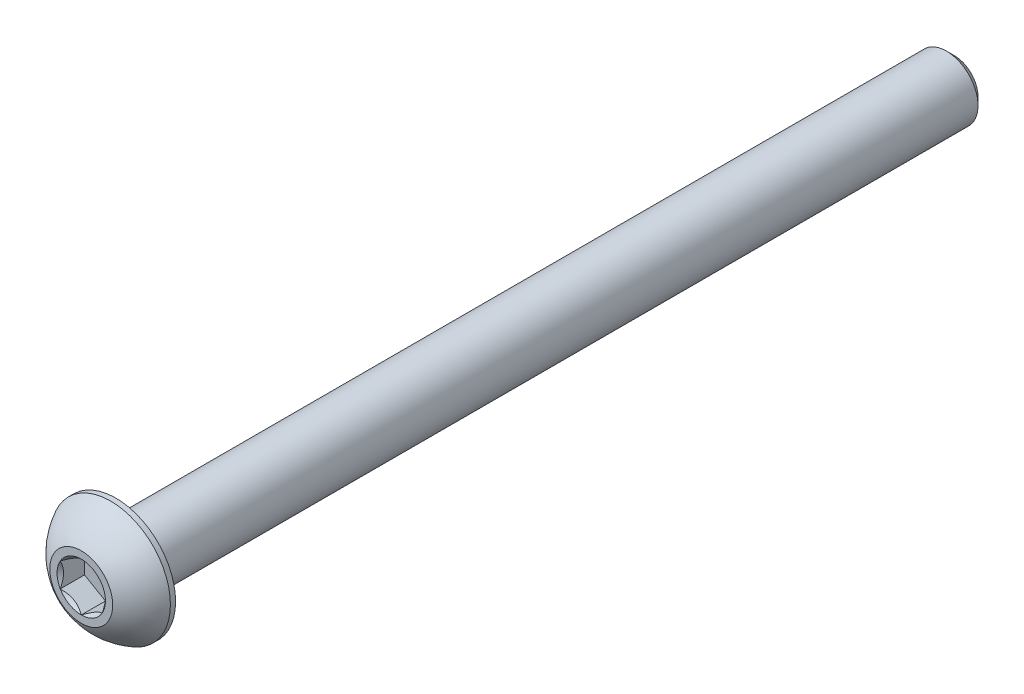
ISO-10303-21;
HEADER;
FILE_DESCRIPTION(('STEP AP214'),'2;1');
FILE_NAME('part.step','',(''),(''),'','','');
FILE_SCHEMA(('AUTOMOTIVE_DESIGN { 1 0 10303 214 1 1 1 1 }'));
ENDSEC;
DATA;
#1=APPLICATION_CONTEXT('core data for automotive mechanical design processes');
#2=APPLICATION_PROTOCOL_DEFINITION('international standard','automotive_design',2000,#1);
#3=PRODUCT_CONTEXT('',#1,'mechanical');
#4=PRODUCT('Part','Part','',(#3));
#5=PRODUCT_RELATED_PRODUCT_CATEGORY('part','',(#4));
#6=PRODUCT_DEFINITION_FORMATION('','',#4);
#7=PRODUCT_DEFINITION_CONTEXT('part definition',#1,'design');
#8=PRODUCT_DEFINITION('design','',#6,#7);
#9=PRODUCT_DEFINITION_SHAPE('','',#8);
#10=(LENGTH_UNIT() NAMED_UNIT(*) SI_UNIT(.MILLI.,.METRE.));
#11=(NAMED_UNIT(*) PLANE_ANGLE_UNIT() SI_UNIT($,.RADIAN.));
#12=(NAMED_UNIT(*) SI_UNIT($,.STERADIAN.) SOLID_ANGLE_UNIT());
#13=UNCERTAINTY_MEASURE_WITH_UNIT(LENGTH_MEASURE(1.E-05),#10,'distance_accuracy_value','');
#14=(GEOMETRIC_REPRESENTATION_CONTEXT(3) GLOBAL_UNCERTAINTY_ASSIGNED_CONTEXT((#13)) GLOBAL_UNIT_ASSIGNED_CONTEXT((#10,
#11,#12)) REPRESENTATION_CONTEXT('',''));
#15=CARTESIAN_POINT('',(0.,0.,0.));
#16=DIRECTION('',(0.,0.,1.));
#17=DIRECTION('',(1.,0.,0.));
#18=AXIS2_PLACEMENT_3D('',#15,#16,#17);
#19=CARTESIAN_POINT('',(0.,-1.5,-41.65));
#20=DIRECTION('',(0.,0.,-1.));
#21=DIRECTION('',(0.,1.,0.));
#22=AXIS2_PLACEMENT_3D('',#19,#20,#21);
#23=PLANE('',#22);
#24=CARTESIAN_POINT('',(0.,0.,-41.65));
#25=DIRECTION('',(0.,0.,-1.));
#26=DIRECTION('',(0.,1.,0.));
#27=AXIS2_PLACEMENT_3D('',#24,#25,#26);
#28=CIRCLE('',#27,1.12499999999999);
#29=CARTESIAN_POINT('',(0.,1.125,-41.65));
#30=VERTEX_POINT('',#29);
#31=EDGE_CURVE('E174',#30,#30,#28,.T.);
#32=ORIENTED_EDGE('',*,*,#31,.T.);
#33=EDGE_LOOP('',(#32));
#34=FACE_BOUND('',#33,.T.);
#35=ADVANCED_FACE('F34',(#34),#23,.T.);
#36=CARTESIAN_POINT('',(0.,0.,-41.65));
#37=DIRECTION('',(0.,0.,-1.));
#38=DIRECTION('',(0.,1.,0.));
#39=AXIS2_PLACEMENT_3D('',#36,#37,#38);
#40=CYLINDRICAL_SURFACE('',#39,1.5);
#41=CARTESIAN_POINT('',(0.,0.,-41.275));
#42=DIRECTION('',(0.,0.,-1.));
#43=DIRECTION('',(0.,1.,0.));
#44=AXIS2_PLACEMENT_3D('',#41,#42,#43);
#45=CIRCLE('',#44,1.5);
#46=CARTESIAN_POINT('',(0.,1.5,-41.275));
#47=VERTEX_POINT('',#46);
#48=EDGE_CURVE('E48',#47,#47,#45,.F.);
#49=ORIENTED_EDGE('',*,*,#48,.T.);
#50=EDGE_LOOP('',(#49));
#51=FACE_BOUND('',#50,.T.);
#52=CARTESIAN_POINT('',(0.,0.,-1.65));
#53=DIRECTION('',(0.,0.,1.));
#54=DIRECTION('',(1.,0.,0.));
#55=AXIS2_PLACEMENT_3D('',#52,#53,#54);
#56=CIRCLE('',#55,1.5);
#57=CARTESIAN_POINT('',(1.5,0.,-1.65));
#58=VERTEX_POINT('',#57);
#59=EDGE_CURVE('E171',#58,#58,#56,.F.);
#60=ORIENTED_EDGE('',*,*,#59,.T.);
#61=EDGE_LOOP('',(#60));
#62=FACE_BOUND('',#61,.T.);
#63=ADVANCED_FACE('F179',(#51,#62),#40,.T.);
#64=CARTESIAN_POINT('',(0.,0.,-41.65));
#65=DIRECTION('',(0.,0.,1.));
#66=DIRECTION('',(0.,-1.,0.));
#67=AXIS2_PLACEMENT_3D('',#64,#65,#66);
#68=CONICAL_SURFACE('',#67,1.12499999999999,0.785398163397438);
#69=ORIENTED_EDGE('',*,*,#48,.F.);
#70=EDGE_LOOP('',(#69));
#71=FACE_BOUND('',#70,.T.);
#72=ORIENTED_EDGE('',*,*,#31,.F.);
#73=EDGE_LOOP('',(#72));
#74=FACE_BOUND('',#73,.T.);
#75=ADVANCED_FACE('F36',(#71,#74),#68,.T.);
#76=CARTESIAN_POINT('',(0.,0.,-2.79483288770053));
#77=DIRECTION('',(0.,0.,1.));
#78=DIRECTION('',(0.,-1.,0.));
#79=AXIS2_PLACEMENT_3D('',#76,#77,#78);
#80=SPHERICAL_SURFACE('',#79,3.17192226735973);
#81=CARTESIAN_POINT('',(0.,0.,0.));
#82=DIRECTION('',(0.,0.,1.));
#83=DIRECTION('',(1.,0.,0.));
#84=AXIS2_PLACEMENT_3D('',#81,#82,#83);
#85=CIRCLE('',#84,1.5);
#86=CARTESIAN_POINT('',(0.,-1.5,0.));
#87=VERTEX_POINT('',#86);
#88=EDGE_CURVE('E168',#87,#87,#85,.T.);
#89=CARTESIAN_POINT('',(0.,0.,-1.4025));
#90=DIRECTION('',(0.,0.,1.));
#91=DIRECTION('',(1.,0.,0.));
#92=AXIS2_PLACEMENT_3D('',#89,#90,#91);
#93=CIRCLE('',#92,2.85);
#94=CARTESIAN_POINT('',(0.,-2.85,-1.4025));
#95=VERTEX_POINT('',#94);
#96=EDGE_CURVE('E162',#95,#95,#93,.T.);
#97=CARTESIAN_POINT('',(0.,-1.5,0.));
#98=CARTESIAN_POINT('',(0.,-1.5181600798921,-0.00974656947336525));
#99=CARTESIAN_POINT('',(0.,-1.53622513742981,-0.0196701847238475));
#100=CARTESIAN_POINT('',(0.,-1.57215840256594,-0.0398676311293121));
#101=CARTESIAN_POINT('',(0.,-1.59002661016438,-0.0501414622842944));
#102=CARTESIAN_POINT('',(0.,-1.6255593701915,-0.0710354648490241));
#103=CARTESIAN_POINT('',(0.,-1.64322392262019,-0.0816556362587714));
#104=CARTESIAN_POINT('',(0.,-1.67834266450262,-0.103238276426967));
#105=CARTESIAN_POINT('',(0.,-1.69579685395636,-0.114200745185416));
#106=CARTESIAN_POINT('',(0.,-1.73048823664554,-0.136463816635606));
#107=CARTESIAN_POINT('',(0.,-1.74772542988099,-0.147764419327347));
#108=CARTESIAN_POINT('',(0.,-1.78197627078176,-0.170699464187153));
#109=CARTESIAN_POINT('',(0.,-1.79898991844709,-0.182333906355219));
#110=CARTESIAN_POINT('',(0.,-1.83278720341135,-0.205932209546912));
#111=CARTESIAN_POINT('',(0.,-1.84957084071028,-0.21789607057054));
#112=CARTESIAN_POINT('',(0.,-1.88290172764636,-0.242148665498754));
#113=CARTESIAN_POINT('',(0.,-1.8994489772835,-0.254437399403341));
#114=CARTESIAN_POINT('',(0.,-1.93230080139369,-0.279335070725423));
#115=CARTESIAN_POINT('',(0.,-1.94860537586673,-0.291944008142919));
#116=CARTESIAN_POINT('',(0.,-1.98096565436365,-0.317477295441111));
#117=CARTESIAN_POINT('',(0.,-1.99702135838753,-0.330401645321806));
#118=CARTESIAN_POINT('',(0.,-2.02887779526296,-0.356560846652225));
#119=CARTESIAN_POINT('',(0.,-2.04467852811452,-0.369795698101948));
#120=CARTESIAN_POINT('',(0.,-2.07601901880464,-0.396570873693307));
#121=CARTESIAN_POINT('',(0.,-2.09155877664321,-0.410111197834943));
#122=CARTESIAN_POINT('',(0.,-2.12237141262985,-0.437492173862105));
#123=CARTESIAN_POINT('',(0.,-2.13764429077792,-0.451332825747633));
#124=CARTESIAN_POINT('',(0.,-2.16791736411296,-0.479309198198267));
#125=CARTESIAN_POINT('',(0.,-2.18291755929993,-0.493444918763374));
#126=CARTESIAN_POINT('',(0.,-2.21263956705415,-0.52200605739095));
#127=CARTESIAN_POINT('',(0.,-2.22736137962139,-0.536431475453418));
#128=CARTESIAN_POINT('',(0.,-2.2565210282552,-0.56556652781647));
#129=CARTESIAN_POINT('',(0.,-2.27095886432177,-0.580276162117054));
#130=CARTESIAN_POINT('',(0.,-2.2995450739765,-0.609974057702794));
#131=CARTESIAN_POINT('',(0.,-2.31369344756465,-0.624962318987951));
#132=CARTESIAN_POINT('',(0.,-2.34169535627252,-0.655211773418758));
#133=CARTESIAN_POINT('',(0.,-2.35554889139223,-0.670472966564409));
#134=CARTESIAN_POINT('',(0.,-2.38295585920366,-0.701262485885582));
#135=CARTESIAN_POINT('',(0.,-2.39650929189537,-0.716790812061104));
#136=CARTESIAN_POINT('',(0.,-2.42331090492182,-0.748108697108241));
#137=CARTESIAN_POINT('',(0.,-2.43655908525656,-0.763898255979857));
#138=CARTESIAN_POINT('',(0.,-2.46274515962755,-0.795732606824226));
#139=CARTESIAN_POINT('',(0.,-2.47568305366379,-0.811777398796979));
#140=CARTESIAN_POINT('',(0.,-2.50124363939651,-0.844116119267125));
#141=CARTESIAN_POINT('',(0.,-2.51386633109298,-0.860410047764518));
#142=CARTESIAN_POINT('',(0.,-2.53879171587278,-0.893240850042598));
#143=CARTESIAN_POINT('',(0.,-2.55109440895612,-0.909777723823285));
#144=CARTESIAN_POINT('',(0.,-2.57537512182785,-0.943088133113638));
#145=CARTESIAN_POINT('',(0.,-2.58735314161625,-0.959861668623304));
#146=CARTESIAN_POINT('',(0.,-2.61097995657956,-0.993639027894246));
#147=CARTESIAN_POINT('',(0.,-2.62262875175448,-1.01064285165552));
#148=CARTESIAN_POINT('',(0.,-2.64559269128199,-1.04487432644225));
#149=CARTESIAN_POINT('',(0.,-2.65690783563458,-1.06210197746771));
#150=CARTESIAN_POINT('',(0.,-2.67920017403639,-1.09677456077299));
#151=CARTESIAN_POINT('',(0.,-2.69017736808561,-1.11421949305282));
#152=CARTESIAN_POINT('',(0.,-2.711789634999,-1.14932001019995));
#153=CARTESIAN_POINT('',(0.,-2.72242470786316,-1.16697559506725));
#154=CARTESIAN_POINT('',(0.,-2.74334869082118,-1.20249070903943));
#155=CARTESIAN_POINT('',(0.,-2.75363760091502,-1.22035023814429));
#156=CARTESIAN_POINT('',(0.,-2.77386535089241,-1.25626645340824));
#157=CARTESIAN_POINT('',(0.,-2.78380419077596,-1.27432313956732));
#158=CARTESIAN_POINT('',(0.,-2.80332801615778,-1.31062681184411));
#159=CARTESIAN_POINT('',(0.,-2.81291300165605,-1.32887379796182));
#160=CARTESIAN_POINT('',(0.,-2.83172550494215,-1.3655511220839));
#161=CARTESIAN_POINT('',(0.,-2.84095302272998,-1.38398146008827));
#162=CARTESIAN_POINT('',(0.,-2.85,-1.4025));
#163=B_SPLINE_CURVE_WITH_KNOTS('',3,(#97,#98,#99,#100,#101,#102,#103,#104,#105,#106,#107,#108,
#109,#110,#111,#112,#113,#114,#115,#116,#117,#118,#119,#120,#121,#122,#123,#124,#125,#126,#127,
#128,#129,#130,#131,#132,#133,#134,#135,#136,#137,#138,#139,#140,#141,#142,#143,#144,#145,#146,
#147,#148,#149,#150,#151,#152,#153,#154,#155,#156,#157,#158,#159,#160,#161,#162),.UNSPECIFIED.,
.F.,.F.,(4,2,2,2,2,2,2,2,2,2,2,2,2,2,2,2,2,2,2,2,2,2,2,2,2,2,2,2,2,2,2,2,4),(0.,
0.0618298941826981,0.123659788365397,0.185489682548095,0.247319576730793,0.309149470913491,
0.37097936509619,0.432809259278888,0.494639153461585,0.556469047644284,0.618298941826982,
0.680128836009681,0.741958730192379,0.803788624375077,0.865618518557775,0.927448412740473,
0.989278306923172,1.05110820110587,1.11293809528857,1.17476798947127,1.23659788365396,
1.29842777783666,1.36025767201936,1.42208756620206,1.48391746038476,1.54574735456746,
1.60757724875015,1.66940714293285,1.73123703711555,1.79306693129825,1.85489682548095,
1.91672671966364,1.97855661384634),.UNSPECIFIED.);
#164=EDGE_CURVE('BSEAM184',#87,#95,#163,.T.);
#165=ORIENTED_EDGE('',*,*,#88,.F.);
#166=ORIENTED_EDGE('',*,*,#96,.T.);
#167=ORIENTED_EDGE('',*,*,#164,.T.);
#168=ORIENTED_EDGE('',*,*,#164,.F.);
#169=EDGE_LOOP('',(#165,#167,#166,#168));
#170=FACE_BOUND('',#169,.T.);
#171=ADVANCED_FACE('F184',(#170),#80,.T.);
#172=CARTESIAN_POINT('',(0.,-1.5,0.));
#173=DIRECTION('',(0.,0.,-1.));
#174=DIRECTION('',(-1.,0.,0.));
#175=AXIS2_PLACEMENT_3D('',#172,#173,#174);
#176=PLANE('',#175);
#177=CARTESIAN_POINT('',(0.,0.,0.));
#178=DIRECTION('',(0.,0.,1.));
#179=DIRECTION('',(1.,0.,0.));
#180=AXIS2_PLACEMENT_3D('',#177,#178,#179);
#181=CIRCLE('',#180,1.15470053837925);
#182=CARTESIAN_POINT('',(-1.,0.577350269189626,0.));
#183=VERTEX_POINT('',#182);
#184=CARTESIAN_POINT('',(-1.,-0.577350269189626,0.));
#185=VERTEX_POINT('',#184);
#186=EDGE_CURVE('E61',#183,#185,#181,.T.);
#187=ORIENTED_EDGE('',*,*,#186,.F.);
#188=CARTESIAN_POINT('',(0.,1.15470053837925,0.));
#189=VERTEX_POINT('',#188);
#190=EDGE_CURVE('E133',#189,#183,#181,.T.);
#191=ORIENTED_EDGE('',*,*,#190,.F.);
#192=CARTESIAN_POINT('',(1.,0.577350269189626,0.));
#193=VERTEX_POINT('',#192);
#194=EDGE_CURVE('E130',#193,#189,#181,.T.);
#195=ORIENTED_EDGE('',*,*,#194,.F.);
#196=CARTESIAN_POINT('',(1.,-0.577350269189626,0.));
#197=VERTEX_POINT('',#196);
#198=EDGE_CURVE('E101',#197,#193,#181,.T.);
#199=ORIENTED_EDGE('',*,*,#198,.F.);
#200=CARTESIAN_POINT('',(0.,-1.15470053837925,0.));
#201=VERTEX_POINT('',#200);
#202=EDGE_CURVE('E93',#201,#197,#181,.T.);
#203=ORIENTED_EDGE('',*,*,#202,.F.);
#204=EDGE_CURVE('E54',#185,#201,#181,.T.);
#205=ORIENTED_EDGE('',*,*,#204,.F.);
#206=EDGE_LOOP('',(#187,#191,#195,#199,#203,#205));
#207=FACE_BOUND('',#206,.T.);
#208=ORIENTED_EDGE('',*,*,#88,.T.);
#209=EDGE_LOOP('',(#208));
#210=FACE_BOUND('',#209,.T.);
#211=ADVANCED_FACE('F127',(#207,#210),#176,.F.);
#212=CARTESIAN_POINT('',(0.,-2.85,-1.65));
#213=DIRECTION('',(0.,0.,1.));
#214=DIRECTION('',(1.,0.,0.));
#215=AXIS2_PLACEMENT_3D('',#212,#213,#214);
#216=PLANE('',#215);
#217=ORIENTED_EDGE('',*,*,#59,.F.);
#218=EDGE_LOOP('',(#217));
#219=FACE_BOUND('',#218,.T.);
#220=CARTESIAN_POINT('',(0.,0.,-1.65));
#221=DIRECTION('',(0.,0.,1.));
#222=DIRECTION('',(1.,0.,0.));
#223=AXIS2_PLACEMENT_3D('',#220,#221,#222);
#224=CIRCLE('',#223,2.85);
#225=CARTESIAN_POINT('',(2.85,0.,-1.65));
#226=VERTEX_POINT('',#225);
#227=EDGE_CURVE('E165',#226,#226,#224,.T.);
#228=ORIENTED_EDGE('',*,*,#227,.F.);
#229=EDGE_LOOP('',(#228));
#230=FACE_BOUND('',#229,.T.);
#231=ADVANCED_FACE('F198',(#219,#230),#216,.F.);
#232=CARTESIAN_POINT('',(0.,0.,0.));
#233=DIRECTION('',(0.,0.,1.));
#234=DIRECTION('',(1.,0.,0.));
#235=AXIS2_PLACEMENT_3D('',#232,#233,#234);
#236=CYLINDRICAL_SURFACE('',#235,2.85);
#237=ORIENTED_EDGE('',*,*,#96,.F.);
#238=EDGE_LOOP('',(#237));
#239=FACE_BOUND('',#238,.T.);
#240=ORIENTED_EDGE('',*,*,#227,.T.);
#241=EDGE_LOOP('',(#240));
#242=FACE_BOUND('',#241,.T.);
#243=ADVANCED_FACE('F201',(#239,#242),#236,.T.);
#244=CARTESIAN_POINT('',(0.,0.,0.));
#245=DIRECTION('',(0.,0.,1.));
#246=DIRECTION('',(1.,0.,0.));
#247=AXIS2_PLACEMENT_3D('',#244,#245,#246);
#248=CONICAL_SURFACE('',#247,1.15470053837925,0.78539816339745);
#249=ORIENTED_EDGE('',*,*,#198,.T.);
#250=CARTESIAN_POINT('',(1.,-1.15147208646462,0.370385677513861));
#251=CARTESIAN_POINT('',(1.,-1.12343447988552,0.349219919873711));
#252=CARTESIAN_POINT('',(1.,-1.09524064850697,0.328261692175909));
#253=CARTESIAN_POINT('',(1.,-1.03847715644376,0.286846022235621));
#254=CARTESIAN_POINT('',(1.,-1.00990740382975,0.266388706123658));
#255=CARTESIAN_POINT('',(1.,-0.923120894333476,0.205604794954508));
#256=CARTESIAN_POINT('',(1.,-0.864253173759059,0.166192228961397));
#257=CARTESIAN_POINT('',(1.,-0.740809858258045,0.0888206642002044));
#258=CARTESIAN_POINT('',(1.,-0.676100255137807,0.0510730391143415));
#259=CARTESIAN_POINT('',(1.,-0.543448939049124,-0.0179754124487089));
#260=CARTESIAN_POINT('',(1.,-0.475519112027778,-0.0492979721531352));
#261=CARTESIAN_POINT('',(1.,-0.373555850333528,-0.0876182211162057));
#262=CARTESIAN_POINT('',(1.,-0.341031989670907,-0.0986164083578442));
#263=CARTESIAN_POINT('',(1.,-0.275199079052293,-0.11800165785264));
#264=CARTESIAN_POINT('',(1.,-0.241889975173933,-0.126388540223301));
#265=CARTESIAN_POINT('',(1.,-0.175247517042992,-0.139974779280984));
#266=CARTESIAN_POINT('',(1.,-0.141925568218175,-0.145229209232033));
#267=CARTESIAN_POINT('',(1.,-0.0749144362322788,-0.152451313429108));
#268=CARTESIAN_POINT('',(1.,-0.0412251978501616,-0.154418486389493));
#269=CARTESIAN_POINT('',(1.,0.0249580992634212,-0.15491680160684));
#270=CARTESIAN_POINT('',(1.,0.0574512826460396,-0.153569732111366));
#271=CARTESIAN_POINT('',(1.,0.122148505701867,-0.147783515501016));
#272=CARTESIAN_POINT('',(1.,0.154352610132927,-0.143345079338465));
#273=CARTESIAN_POINT('',(1.,0.21879989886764,-0.131543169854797));
#274=CARTESIAN_POINT('',(1.,0.251033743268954,-0.124129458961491));
#275=CARTESIAN_POINT('',(1.,0.314797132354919,-0.106771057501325));
#276=CARTESIAN_POINT('',(1.,0.346326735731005,-0.0968265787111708));
#277=CARTESIAN_POINT('',(1.,0.445594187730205,-0.0617765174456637));
#278=CARTESIAN_POINT('',(1.,0.511919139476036,-0.0326791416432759));
#279=CARTESIAN_POINT('',(1.,0.641453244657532,0.0320153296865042));
#280=CARTESIAN_POINT('',(1.,0.704650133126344,0.0676357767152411));
#281=CARTESIAN_POINT('',(1.,0.825428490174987,0.141123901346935));
#282=CARTESIAN_POINT('',(1.,0.883132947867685,0.178791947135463));
#283=CARTESIAN_POINT('',(1.,0.968148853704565,0.237022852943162));
#284=CARTESIAN_POINT('',(1.,0.996120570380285,0.256638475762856));
#285=CARTESIAN_POINT('',(1.,1.05168177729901,0.29638851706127));
#286=CARTESIAN_POINT('',(1.,1.079271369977,0.316522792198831));
#287=CARTESIAN_POINT('',(1.,1.10670185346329,0.336872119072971));
#288=B_SPLINE_CURVE_WITH_KNOTS('',3,(#250,#251,#252,#253,#254,#255,#256,#257,#258,#259,#260,
#261,#262,#263,#264,#265,#266,#267,#268,#269,#270,#271,#272,#273,#274,#275,#276,#277,#278,#279,
#280,#281,#282,#283,#284,#285,#286,#287),.UNSPECIFIED.,.F.,.F.,(4,2,2,2,2,2,2,2,2,2,2,2,2,2,2,2,
2,2,4),(0.,0.105386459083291,0.210799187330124,0.423233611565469,0.647793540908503,
0.871580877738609,0.97449307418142,1.07741235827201,1.17846428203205,1.27953161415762,
1.3769408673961,1.47432772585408,1.57343322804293,1.67253043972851,1.88917353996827,
2.10660791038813,2.31323734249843,2.41572589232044,2.51818641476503),.UNSPECIFIED.);
#289=EDGE_CURVE('E11',#197,#193,#288,.T.);
#290=ORIENTED_EDGE('',*,*,#289,.F.);
#291=EDGE_LOOP('',(#249,#290));
#292=FACE_BOUND('',#291,.T.);
#293=ADVANCED_FACE('F105',(#292),#248,.F.);
#294=ORIENTED_EDGE('',*,*,#194,.T.);
#295=CARTESIAN_POINT('',(1.0002,0.577234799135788,0.000115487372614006));
#296=CARTESIAN_POINT('',(0.965817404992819,0.597085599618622,-0.0197220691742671));
#297=CARTESIAN_POINT('',(0.930859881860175,0.617268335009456,-0.0383949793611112));
#298=CARTESIAN_POINT('',(0.85957719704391,0.658423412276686,-0.0725852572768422));
#299=CARTESIAN_POINT('',(0.823245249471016,0.67939967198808,-0.0880835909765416));
#300=CARTESIAN_POINT('',(0.749983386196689,0.721697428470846,-0.114632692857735));
#301=CARTESIAN_POINT('',(0.713072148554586,0.743008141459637,-0.125750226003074));
#302=CARTESIAN_POINT('',(0.638437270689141,0.786098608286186,-0.142880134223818));
#303=CARTESIAN_POINT('',(0.600715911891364,0.807877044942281,-0.148905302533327));
#304=CARTESIAN_POINT('',(0.535707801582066,0.845409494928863,-0.154339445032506));
#305=CARTESIAN_POINT('',(0.508505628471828,0.861114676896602,-0.155143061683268));
#306=CARTESIAN_POINT('',(0.454153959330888,0.892494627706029,-0.153793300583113));
#307=CARTESIAN_POINT('',(0.427004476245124,0.908169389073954,-0.151639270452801));
#308=CARTESIAN_POINT('',(0.345943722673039,0.954969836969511,-0.140883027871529));
#309=CARTESIAN_POINT('',(0.292435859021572,0.985862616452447,-0.127985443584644));
#310=CARTESIAN_POINT('',(0.198523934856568,1.04008269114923,-0.0968592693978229));
#311=CARTESIAN_POINT('',(0.157679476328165,1.06366425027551,-0.0802622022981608));
#312=CARTESIAN_POINT('',(0.077590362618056,1.1099037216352,-0.0428750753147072));
#313=CARTESIAN_POINT('',(0.038340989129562,1.1325643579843,-0.0220986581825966));
#314=CARTESIAN_POINT('',(-0.000200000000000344,1.15481600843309,0.000115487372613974));
#315=B_SPLINE_CURVE_WITH_KNOTS('',3,(#295,#296,#297,#298,#299,#300,#301,#302,#303,#304,#305,
#306,#307,#308,#309,#310,#311,#312,#313,#314),.UNSPECIFIED.,.F.,.F.,(4,2,2,2,2,2,2,2,2,4),(0.,
0.133237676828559,0.26725222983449,0.3991370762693,0.530689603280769,0.624814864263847,
0.718960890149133,0.907306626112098,1.05710100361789,1.20641411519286),.UNSPECIFIED.);
#316=EDGE_CURVE('E132',#193,#189,#315,.T.);
#317=ORIENTED_EDGE('',*,*,#316,.F.);
#318=EDGE_LOOP('',(#294,#317));
#319=FACE_BOUND('',#318,.T.);
#320=ADVANCED_FACE('F286',(#319),#248,.F.);
#321=ORIENTED_EDGE('',*,*,#190,.T.);
#322=CARTESIAN_POINT('',(0.000199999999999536,1.15481600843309,0.000115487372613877));
#323=CARTESIAN_POINT('',(-0.0341825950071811,1.13496520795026,-0.0197220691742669));
#324=CARTESIAN_POINT('',(-0.0691401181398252,1.11478247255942,-0.038394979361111));
#325=CARTESIAN_POINT('',(-0.14042280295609,1.07362739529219,-0.0725852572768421));
#326=CARTESIAN_POINT('',(-0.176754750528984,1.0526511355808,-0.0880835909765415));
#327=CARTESIAN_POINT('',(-0.250016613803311,1.01035337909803,-0.114632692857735));
#328=CARTESIAN_POINT('',(-0.286927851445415,0.989042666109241,-0.125750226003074));
#329=CARTESIAN_POINT('',(-0.36156272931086,0.945952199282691,-0.142880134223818));
#330=CARTESIAN_POINT('',(-0.399284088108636,0.924173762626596,-0.148905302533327));
#331=CARTESIAN_POINT('',(-0.464292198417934,0.886641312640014,-0.154339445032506));
#332=CARTESIAN_POINT('',(-0.491494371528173,0.870936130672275,-0.155143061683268));
#333=CARTESIAN_POINT('',(-0.545846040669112,0.839556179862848,-0.153793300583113));
#334=CARTESIAN_POINT('',(-0.572995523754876,0.823881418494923,-0.151639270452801));
#335=CARTESIAN_POINT('',(-0.654056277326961,0.777080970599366,-0.140883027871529));
#336=CARTESIAN_POINT('',(-0.707564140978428,0.74618819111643,-0.127985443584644));
#337=CARTESIAN_POINT('',(-0.801476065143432,0.691968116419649,-0.0968592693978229));
#338=CARTESIAN_POINT('',(-0.842320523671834,0.668386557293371,-0.0802622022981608));
#339=CARTESIAN_POINT('',(-0.922409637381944,0.622147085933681,-0.0428750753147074));
#340=CARTESIAN_POINT('',(-0.961659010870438,0.599486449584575,-0.0220986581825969));
#341=CARTESIAN_POINT('',(-1.0002,0.577234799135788,0.000115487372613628));
#342=B_SPLINE_CURVE_WITH_KNOTS('',3,(#322,#323,#324,#325,#326,#327,#328,#329,#330,#331,#332,
#333,#334,#335,#336,#337,#338,#339,#340,#341),.UNSPECIFIED.,.F.,.F.,(4,2,2,2,2,2,2,2,2,4),(0.,
0.133237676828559,0.26725222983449,0.3991370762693,0.530689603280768,0.624814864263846,
0.718960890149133,0.907306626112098,1.05710100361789,1.20641411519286),.UNSPECIFIED.);
#343=EDGE_CURVE('E137',#189,#183,#342,.T.);
#344=ORIENTED_EDGE('',*,*,#343,.F.);
#345=EDGE_LOOP('',(#321,#344));
#346=FACE_BOUND('',#345,.T.);
#347=ADVANCED_FACE('F140',(#346),#248,.F.);
#348=ORIENTED_EDGE('',*,*,#186,.T.);
#349=CARTESIAN_POINT('',(-1.,-1.15147208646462,0.370385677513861));
#350=CARTESIAN_POINT('',(-1.,-1.12343447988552,0.349219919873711));
#351=CARTESIAN_POINT('',(-1.,-1.09524064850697,0.328261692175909));
#352=CARTESIAN_POINT('',(-1.,-1.03847715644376,0.286846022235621));
#353=CARTESIAN_POINT('',(-1.,-1.00990740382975,0.266388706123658));
#354=CARTESIAN_POINT('',(-1.,-0.923120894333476,0.205604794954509));
#355=CARTESIAN_POINT('',(-1.,-0.864253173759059,0.166192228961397));
#356=CARTESIAN_POINT('',(-1.,-0.740809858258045,0.0888206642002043));
#357=CARTESIAN_POINT('',(-1.,-0.676100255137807,0.0510730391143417));
#358=CARTESIAN_POINT('',(-1.,-0.543448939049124,-0.0179754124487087));
#359=CARTESIAN_POINT('',(-1.,-0.475519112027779,-0.0492979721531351));
#360=CARTESIAN_POINT('',(-1.,-0.373555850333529,-0.0876182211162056));
#361=CARTESIAN_POINT('',(-1.,-0.341031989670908,-0.0986164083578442));
#362=CARTESIAN_POINT('',(-1.,-0.275199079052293,-0.11800165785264));
#363=CARTESIAN_POINT('',(-1.,-0.241889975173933,-0.126388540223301));
#364=CARTESIAN_POINT('',(-1.,-0.175247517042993,-0.139974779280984));
#365=CARTESIAN_POINT('',(-1.,-0.141925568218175,-0.145229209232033));
#366=CARTESIAN_POINT('',(-1.,-0.0749144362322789,-0.152451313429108));
#367=CARTESIAN_POINT('',(-1.,-0.0412251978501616,-0.154418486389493));
#368=CARTESIAN_POINT('',(-1.,0.0249580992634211,-0.15491680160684));
#369=CARTESIAN_POINT('',(-1.,0.0574512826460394,-0.153569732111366));
#370=CARTESIAN_POINT('',(-1.,0.122148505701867,-0.147783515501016));
#371=CARTESIAN_POINT('',(-1.,0.154352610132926,-0.143345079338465));
#372=CARTESIAN_POINT('',(-1.,0.21879989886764,-0.131543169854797));
#373=CARTESIAN_POINT('',(-1.,0.251033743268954,-0.124129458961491));
#374=CARTESIAN_POINT('',(-1.,0.314797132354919,-0.106771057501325));
#375=CARTESIAN_POINT('',(-1.,0.346326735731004,-0.0968265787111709));
#376=CARTESIAN_POINT('',(-1.,0.445594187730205,-0.0617765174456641));
#377=CARTESIAN_POINT('',(-1.,0.511919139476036,-0.0326791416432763));
#378=CARTESIAN_POINT('',(-1.,0.641453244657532,0.0320153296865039));
#379=CARTESIAN_POINT('',(-1.,0.704650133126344,0.0676357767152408));
#380=CARTESIAN_POINT('',(-1.,0.825428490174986,0.141123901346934));
#381=CARTESIAN_POINT('',(-1.,0.883132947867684,0.178791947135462));
#382=CARTESIAN_POINT('',(-1.,0.968148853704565,0.237022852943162));
#383=CARTESIAN_POINT('',(-1.,0.996120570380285,0.256638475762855));
#384=CARTESIAN_POINT('',(-1.,1.05168177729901,0.29638851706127));
#385=CARTESIAN_POINT('',(-1.,1.079271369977,0.316522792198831));
#386=CARTESIAN_POINT('',(-1.,1.10670185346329,0.336872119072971));
#387=B_SPLINE_CURVE_WITH_KNOTS('',3,(#349,#350,#351,#352,#353,#354,#355,#356,#357,#358,#359,
#360,#361,#362,#363,#364,#365,#366,#367,#368,#369,#370,#371,#372,#373,#374,#375,#376,#377,#378,
#379,#380,#381,#382,#383,#384,#385,#386),.UNSPECIFIED.,.F.,.F.,(4,2,2,2,2,2,2,2,2,2,2,2,2,2,2,2,
2,2,4),(0.,0.105386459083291,0.210799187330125,0.423233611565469,0.647793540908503,
0.871580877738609,0.97449307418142,1.07741235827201,1.17846428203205,1.27953161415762,
1.3769408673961,1.47432772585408,1.57343322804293,1.67253043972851,1.88917353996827,
2.10660791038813,2.31323734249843,2.41572589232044,2.51818641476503),.UNSPECIFIED.);
#388=EDGE_CURVE('E144',#183,#185,#387,.F.);
#389=ORIENTED_EDGE('',*,*,#388,.F.);
#390=EDGE_LOOP('',(#348,#389));
#391=FACE_BOUND('',#390,.T.);
#392=ADVANCED_FACE('F280',(#391),#248,.F.);
#393=ORIENTED_EDGE('',*,*,#204,.T.);
#394=CARTESIAN_POINT('',(-1.0002,-0.577234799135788,0.000115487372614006));
#395=CARTESIAN_POINT('',(-0.965817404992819,-0.597085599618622,-0.0197220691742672));
#396=CARTESIAN_POINT('',(-0.930859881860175,-0.617268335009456,-0.0383949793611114));
#397=CARTESIAN_POINT('',(-0.85957719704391,-0.658423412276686,-0.0725852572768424));
#398=CARTESIAN_POINT('',(-0.823245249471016,-0.67939967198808,-0.0880835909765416));
#399=CARTESIAN_POINT('',(-0.749983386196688,-0.721697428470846,-0.114632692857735));
#400=CARTESIAN_POINT('',(-0.713072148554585,-0.743008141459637,-0.125750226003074));
#401=CARTESIAN_POINT('',(-0.638437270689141,-0.786098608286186,-0.142880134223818));
#402=CARTESIAN_POINT('',(-0.600715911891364,-0.807877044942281,-0.148905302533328));
#403=CARTESIAN_POINT('',(-0.535707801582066,-0.845409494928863,-0.154339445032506));
#404=CARTESIAN_POINT('',(-0.508505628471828,-0.861114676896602,-0.155143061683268));
#405=CARTESIAN_POINT('',(-0.454153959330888,-0.892494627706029,-0.153793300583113));
#406=CARTESIAN_POINT('',(-0.427004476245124,-0.908169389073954,-0.151639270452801));
#407=CARTESIAN_POINT('',(-0.34594372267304,-0.954969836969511,-0.140883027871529));
#408=CARTESIAN_POINT('',(-0.292435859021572,-0.985862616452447,-0.127985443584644));
#409=CARTESIAN_POINT('',(-0.198523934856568,-1.04008269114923,-0.0968592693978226));
#410=CARTESIAN_POINT('',(-0.157679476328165,-1.06366425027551,-0.0802622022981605));
#411=CARTESIAN_POINT('',(-0.0775903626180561,-1.1099037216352,-0.0428750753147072));
#412=CARTESIAN_POINT('',(-0.0383409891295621,-1.1325643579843,-0.0220986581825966));
#413=CARTESIAN_POINT('',(0.000200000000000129,-1.15481600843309,0.000115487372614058));
#414=B_SPLINE_CURVE_WITH_KNOTS('',3,(#394,#395,#396,#397,#398,#399,#400,#401,#402,#403,#404,
#405,#406,#407,#408,#409,#410,#411,#412,#413),.UNSPECIFIED.,.F.,.F.,(4,2,2,2,2,2,2,2,2,4),(0.,
0.133237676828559,0.267252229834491,0.399137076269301,0.530689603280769,0.624814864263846,
0.718960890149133,0.907306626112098,1.05710100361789,1.20641411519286),.UNSPECIFIED.);
#415=EDGE_CURVE('E117',#185,#201,#414,.T.);
#416=ORIENTED_EDGE('',*,*,#415,.F.);
#417=EDGE_LOOP('',(#393,#416));
#418=FACE_BOUND('',#417,.T.);
#419=ADVANCED_FACE('F228',(#418),#248,.F.);
#420=ORIENTED_EDGE('',*,*,#202,.T.);
#421=CARTESIAN_POINT('',(-0.000199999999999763,-1.15481600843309,0.000115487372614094));
#422=CARTESIAN_POINT('',(0.0341825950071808,-1.13496520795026,-0.0197220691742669));
#423=CARTESIAN_POINT('',(0.069140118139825,-1.11478247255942,-0.0383949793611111));
#424=CARTESIAN_POINT('',(0.14042280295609,-1.07362739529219,-0.072585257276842));
#425=CARTESIAN_POINT('',(0.176754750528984,-1.0526511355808,-0.0880835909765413));
#426=CARTESIAN_POINT('',(0.250016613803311,-1.01035337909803,-0.114632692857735));
#427=CARTESIAN_POINT('',(0.286927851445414,-0.989042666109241,-0.125750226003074));
#428=CARTESIAN_POINT('',(0.361562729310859,-0.945952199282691,-0.142880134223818));
#429=CARTESIAN_POINT('',(0.399284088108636,-0.924173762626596,-0.148905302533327));
#430=CARTESIAN_POINT('',(0.464292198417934,-0.886641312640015,-0.154339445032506));
#431=CARTESIAN_POINT('',(0.491494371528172,-0.870936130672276,-0.155143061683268));
#432=CARTESIAN_POINT('',(0.545846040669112,-0.839556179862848,-0.153793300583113));
#433=CARTESIAN_POINT('',(0.572995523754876,-0.823881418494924,-0.151639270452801));
#434=CARTESIAN_POINT('',(0.65405627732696,-0.777080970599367,-0.140883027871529));
#435=CARTESIAN_POINT('',(0.707564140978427,-0.74618819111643,-0.127985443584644));
#436=CARTESIAN_POINT('',(0.801476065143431,-0.691968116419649,-0.0968592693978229));
#437=CARTESIAN_POINT('',(0.842320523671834,-0.668386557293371,-0.0802622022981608));
#438=CARTESIAN_POINT('',(0.922409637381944,-0.622147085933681,-0.0428750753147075));
#439=CARTESIAN_POINT('',(0.961659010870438,-0.599486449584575,-0.022098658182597));
#440=CARTESIAN_POINT('',(1.0002,-0.577234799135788,0.000115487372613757));
#441=B_SPLINE_CURVE_WITH_KNOTS('',3,(#421,#422,#423,#424,#425,#426,#427,#428,#429,#430,#431,
#432,#433,#434,#435,#436,#437,#438,#439,#440),.UNSPECIFIED.,.F.,.F.,(4,2,2,2,2,2,2,2,2,4),(0.,
0.133237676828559,0.26725222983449,0.3991370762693,0.530689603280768,0.624814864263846,
0.718960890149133,0.907306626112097,1.05710100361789,1.20641411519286),.UNSPECIFIED.);
#442=EDGE_CURVE('E97',#201,#197,#441,.T.);
#443=ORIENTED_EDGE('',*,*,#442,.F.);
#444=EDGE_LOOP('',(#420,#443));
#445=FACE_BOUND('',#444,.T.);
#446=ADVANCED_FACE('F95',(#445),#248,.F.);
#447=CARTESIAN_POINT('',(1.,-0.577350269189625,-1.155));
#448=DIRECTION('',(0.,0.,1.));
#449=DIRECTION('',(1.,0.,0.));
#450=AXIS2_PLACEMENT_3D('',#447,#448,#449);
#451=PLANE('',#450);
#452=DIRECTION('',(0.866025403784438,0.5,0.));
#453=VECTOR('',#452,1.);
#454=CARTESIAN_POINT('',(0.,-1.15470053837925,-1.155));
#455=LINE('',#454,#453);
#456=CARTESIAN_POINT('',(0.,-1.15470053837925,-1.155));
#457=VERTEX_POINT('',#456);
#458=CARTESIAN_POINT('',(1.,-0.577350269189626,-1.155));
#459=VERTEX_POINT('',#458);
#460=EDGE_CURVE('E116',#457,#459,#455,.T.);
#461=ORIENTED_EDGE('',*,*,#460,.T.);
#462=DIRECTION('',(0.,1.,0.));
#463=VECTOR('',#462,1.);
#464=CARTESIAN_POINT('',(1.,-0.577350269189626,-1.155));
#465=LINE('',#464,#463);
#466=CARTESIAN_POINT('',(1.,0.577350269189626,-1.155));
#467=VERTEX_POINT('',#466);
#468=EDGE_CURVE('E121',#459,#467,#465,.T.);
#469=ORIENTED_EDGE('',*,*,#468,.T.);
#470=DIRECTION('',(-0.866025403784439,0.5,0.));
#471=VECTOR('',#470,1.);
#472=CARTESIAN_POINT('',(1.,0.577350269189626,-1.155));
#473=LINE('',#472,#471);
#474=CARTESIAN_POINT('',(0.,1.15470053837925,-1.155));
#475=VERTEX_POINT('',#474);
#476=EDGE_CURVE('E270',#467,#475,#473,.T.);
#477=ORIENTED_EDGE('',*,*,#476,.T.);
#478=DIRECTION('',(-0.866025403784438,-0.5,0.));
#479=VECTOR('',#478,1.);
#480=CARTESIAN_POINT('',(0.,1.15470053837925,-1.155));
#481=LINE('',#480,#479);
#482=CARTESIAN_POINT('',(-1.,0.577350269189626,-1.155));
#483=VERTEX_POINT('',#482);
#484=EDGE_CURVE('E153',#475,#483,#481,.T.);
#485=ORIENTED_EDGE('',*,*,#484,.T.);
#486=DIRECTION('',(0.,-1.,0.));
#487=VECTOR('',#486,1.);
#488=CARTESIAN_POINT('',(-1.,0.577350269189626,-1.155));
#489=LINE('',#488,#487);
#490=CARTESIAN_POINT('',(-1.,-0.577350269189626,-1.155));
#491=VERTEX_POINT('',#490);
#492=EDGE_CURVE('E274',#483,#491,#489,.T.);
#493=ORIENTED_EDGE('',*,*,#492,.T.);
#494=DIRECTION('',(0.866025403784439,-0.5,0.));
#495=VECTOR('',#494,1.);
#496=CARTESIAN_POINT('',(-1.,-0.577350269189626,-1.155));
#497=LINE('',#496,#495);
#498=EDGE_CURVE('E124',#491,#457,#497,.T.);
#499=ORIENTED_EDGE('',*,*,#498,.T.);
#500=EDGE_LOOP('',(#461,#469,#477,#485,#493,#499));
#501=FACE_BOUND('',#500,.T.);
#502=ADVANCED_FACE('F227',(#501),#451,.T.);
#503=CARTESIAN_POINT('',(1.,-0.577350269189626,-1.155));
#504=DIRECTION('',(1.,0.,0.));
#505=DIRECTION('',(0.,0.,-1.));
#506=AXIS2_PLACEMENT_3D('',#503,#504,#505);
#507=PLANE('',#506);
#508=DIRECTION('',(0.,0.,1.));
#509=VECTOR('',#508,1.);
#510=CARTESIAN_POINT('',(1.,-0.577350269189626,-1.155));
#511=LINE('',#510,#509);
#512=EDGE_CURVE('E113',#459,#197,#511,.T.);
#513=ORIENTED_EDGE('',*,*,#512,.T.);
#514=ORIENTED_EDGE('',*,*,#289,.T.);
#515=DIRECTION('',(0.,0.,1.));
#516=VECTOR('',#515,1.);
#517=CARTESIAN_POINT('',(1.,0.577350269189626,-1.155));
#518=LINE('',#517,#516);
#519=EDGE_CURVE('E123',#467,#193,#518,.T.);
#520=ORIENTED_EDGE('',*,*,#519,.F.);
#521=ORIENTED_EDGE('',*,*,#468,.F.);
#522=EDGE_LOOP('',(#513,#514,#520,#521));
#523=FACE_BOUND('',#522,.T.);
#524=ADVANCED_FACE('F119',(#523),#507,.F.);
#525=CARTESIAN_POINT('',(1.,0.577350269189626,-1.155));
#526=DIRECTION('',(0.5,0.866025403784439,0.));
#527=DIRECTION('',(-0.866025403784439,0.5,0.));
#528=AXIS2_PLACEMENT_3D('',#525,#526,#527);
#529=PLANE('',#528);
#530=ORIENTED_EDGE('',*,*,#519,.T.);
#531=ORIENTED_EDGE('',*,*,#316,.T.);
#532=DIRECTION('',(0.,0.,1.));
#533=VECTOR('',#532,1.);
#534=CARTESIAN_POINT('',(0.,1.15470053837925,-1.155));
#535=LINE('',#534,#533);
#536=EDGE_CURVE('E149',#475,#189,#535,.T.);
#537=ORIENTED_EDGE('',*,*,#536,.F.);
#538=ORIENTED_EDGE('',*,*,#476,.F.);
#539=EDGE_LOOP('',(#530,#531,#537,#538));
#540=FACE_BOUND('',#539,.T.);
#541=ADVANCED_FACE('F147',(#540),#529,.F.);
#542=CARTESIAN_POINT('',(0.,1.15470053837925,-1.155));
#543=DIRECTION('',(-0.5,0.866025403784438,0.));
#544=DIRECTION('',(-0.866025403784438,-0.5,0.));
#545=AXIS2_PLACEMENT_3D('',#542,#543,#544);
#546=PLANE('',#545);
#547=ORIENTED_EDGE('',*,*,#536,.T.);
#548=ORIENTED_EDGE('',*,*,#343,.T.);
#549=DIRECTION('',(0.,0.,1.));
#550=VECTOR('',#549,1.);
#551=CARTESIAN_POINT('',(-1.,0.577350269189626,-1.155));
#552=LINE('',#551,#550);
#553=EDGE_CURVE('E155',#483,#183,#552,.T.);
#554=ORIENTED_EDGE('',*,*,#553,.F.);
#555=ORIENTED_EDGE('',*,*,#484,.F.);
#556=EDGE_LOOP('',(#547,#548,#554,#555));
#557=FACE_BOUND('',#556,.T.);
#558=ADVANCED_FACE('F151',(#557),#546,.F.);
#559=CARTESIAN_POINT('',(-1.,0.577350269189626,-1.155));
#560=DIRECTION('',(-1.,0.,0.));
#561=DIRECTION('',(0.,0.,1.));
#562=AXIS2_PLACEMENT_3D('',#559,#560,#561);
#563=PLANE('',#562);
#564=ORIENTED_EDGE('',*,*,#553,.T.);
#565=ORIENTED_EDGE('',*,*,#388,.T.);
#566=DIRECTION('',(0.,0.,1.));
#567=VECTOR('',#566,1.);
#568=CARTESIAN_POINT('',(-1.,-0.577350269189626,-1.155));
#569=LINE('',#568,#567);
#570=EDGE_CURVE('E157',#491,#185,#569,.T.);
#571=ORIENTED_EDGE('',*,*,#570,.F.);
#572=ORIENTED_EDGE('',*,*,#492,.F.);
#573=EDGE_LOOP('',(#564,#565,#571,#572));
#574=FACE_BOUND('',#573,.T.);
#575=ADVANCED_FACE('F249',(#574),#563,.F.);
#576=CARTESIAN_POINT('',(-1.,-0.577350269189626,-1.155));
#577=DIRECTION('',(-0.5,-0.866025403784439,0.));
#578=DIRECTION('',(0.866025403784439,-0.5,0.));
#579=AXIS2_PLACEMENT_3D('',#576,#577,#578);
#580=PLANE('',#579);
#581=ORIENTED_EDGE('',*,*,#570,.T.);
#582=ORIENTED_EDGE('',*,*,#415,.T.);
#583=DIRECTION('',(0.,0.,1.));
#584=VECTOR('',#583,1.);
#585=CARTESIAN_POINT('',(0.,-1.15470053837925,-1.155));
#586=LINE('',#585,#584);
#587=EDGE_CURVE('E115',#457,#201,#586,.T.);
#588=ORIENTED_EDGE('',*,*,#587,.F.);
#589=ORIENTED_EDGE('',*,*,#498,.F.);
#590=EDGE_LOOP('',(#581,#582,#588,#589));
#591=FACE_BOUND('',#590,.T.);
#592=ADVANCED_FACE('F208',(#591),#580,.F.);
#593=CARTESIAN_POINT('',(0.,-1.15470053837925,-1.155));
#594=DIRECTION('',(0.5,-0.866025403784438,0.));
#595=DIRECTION('',(0.866025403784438,0.5,0.));
#596=AXIS2_PLACEMENT_3D('',#593,#594,#595);
#597=PLANE('',#596);
#598=ORIENTED_EDGE('',*,*,#587,.T.);
#599=ORIENTED_EDGE('',*,*,#442,.T.);
#600=ORIENTED_EDGE('',*,*,#512,.F.);
#601=ORIENTED_EDGE('',*,*,#460,.F.);
#602=EDGE_LOOP('',(#598,#599,#600,#601));
#603=FACE_BOUND('',#602,.T.);
#604=ADVANCED_FACE('F111',(#603),#597,.F.);
#605=CLOSED_SHELL('',(#35,#63,#75,#171,#211,#231,#243,#293,#320,#347,#392,#419,#446,#502,#524,
#541,#558,#575,#592,#604));
#606=MANIFOLD_SOLID_BREP('B2',#605);
#607=ADVANCED_BREP_SHAPE_REPRESENTATION('',(#18,#606),#14);
#608=SHAPE_DEFINITION_REPRESENTATION(#9,#607);
ENDSEC;
END-ISO-10303-21;
